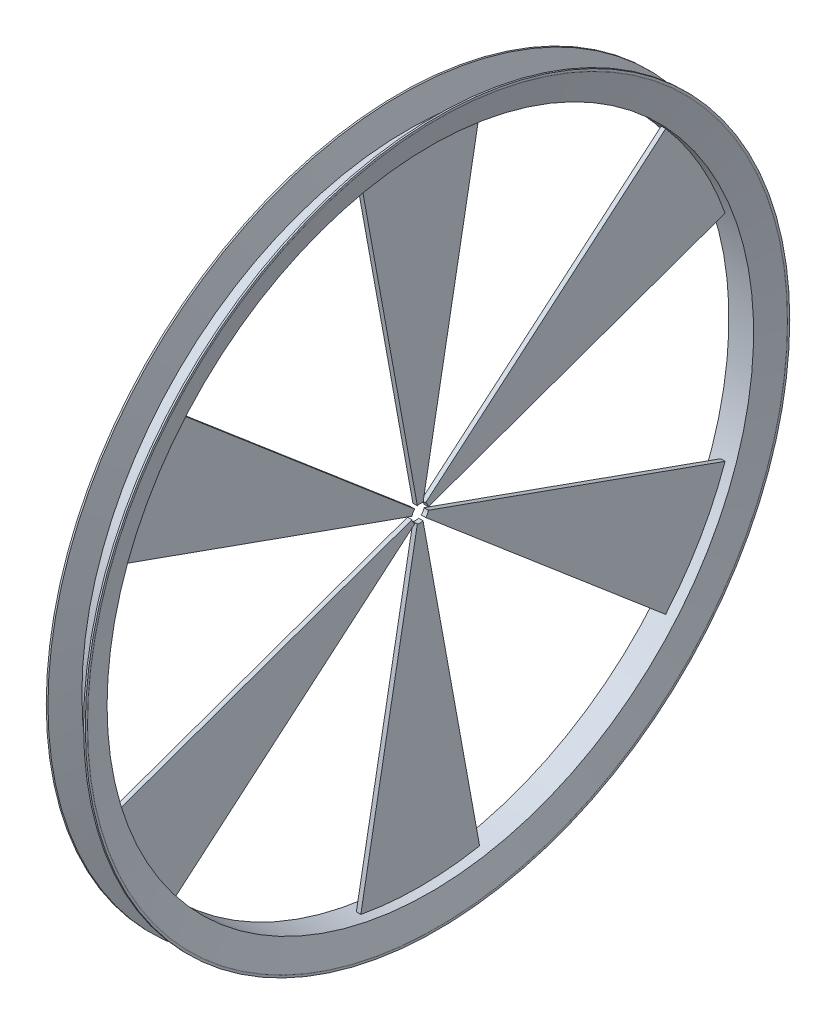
ISO-10303-21;
HEADER;
FILE_DESCRIPTION(('STEP AP214'),'2;1');
FILE_NAME('part.step','',(''),(''),'','','');
FILE_SCHEMA(('AUTOMOTIVE_DESIGN { 1 0 10303 214 1 1 1 1 }'));
ENDSEC;
DATA;
#1=APPLICATION_CONTEXT('core data for automotive mechanical design processes');
#2=APPLICATION_PROTOCOL_DEFINITION('international standard','automotive_design',2000,#1);
#3=PRODUCT_CONTEXT('',#1,'mechanical');
#4=PRODUCT('Part','Part','',(#3));
#5=PRODUCT_RELATED_PRODUCT_CATEGORY('part','',(#4));
#6=PRODUCT_DEFINITION_FORMATION('','',#4);
#7=PRODUCT_DEFINITION_CONTEXT('part definition',#1,'design');
#8=PRODUCT_DEFINITION('design','',#6,#7);
#9=PRODUCT_DEFINITION_SHAPE('','',#8);
#10=(LENGTH_UNIT() NAMED_UNIT(*) SI_UNIT(.MILLI.,.METRE.));
#11=(NAMED_UNIT(*) PLANE_ANGLE_UNIT() SI_UNIT($,.RADIAN.));
#12=(NAMED_UNIT(*) SI_UNIT($,.STERADIAN.) SOLID_ANGLE_UNIT());
#13=UNCERTAINTY_MEASURE_WITH_UNIT(LENGTH_MEASURE(1.E-05),#10,'distance_accuracy_value','');
#14=(GEOMETRIC_REPRESENTATION_CONTEXT(3) GLOBAL_UNCERTAINTY_ASSIGNED_CONTEXT((#13)) GLOBAL_UNIT_ASSIGNED_CONTEXT((#10,
#11,#12)) REPRESENTATION_CONTEXT('',''));
#15=CARTESIAN_POINT('',(0.,0.,0.));
#16=DIRECTION('',(0.,0.,1.));
#17=DIRECTION('',(1.,0.,0.));
#18=AXIS2_PLACEMENT_3D('',#15,#16,#17);
#19=CARTESIAN_POINT('',(-3.65850924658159,-289.525905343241,0.));
#20=DIRECTION('',(-1.,0.,0.));
#21=DIRECTION('',(0.,0.,1.));
#22=AXIS2_PLACEMENT_3D('',#19,#20,#21);
#23=CYLINDRICAL_SURFACE('',#22,290.025905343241);
#24=DIRECTION('',(1.,0.,0.));
#25=VECTOR('',#24,1.);
#26=CARTESIAN_POINT('',(-2.,-385.923205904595,273.53717519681));
#27=LINE('',#26,#25);
#28=CARTESIAN_POINT('',(-2.,-385.923205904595,273.53717519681));
#29=VERTEX_POINT('',#28);
#30=CARTESIAN_POINT('',(2.,-385.923205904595,273.53717519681));
#31=VERTEX_POINT('',#30);
#32=EDGE_CURVE('E64',#29,#31,#27,.T.);
#33=ORIENTED_EDGE('',*,*,#32,.F.);
#34=CARTESIAN_POINT('',(-2.,-289.525905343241,0.));
#35=DIRECTION('',(1.,0.,0.));
#36=DIRECTION('',(0.,0.866025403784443,0.499999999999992));
#37=AXIS2_PLACEMENT_3D('',#34,#35,#36);
#38=CIRCLE('',#37,290.025905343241);
#39=CARTESIAN_POINT('',(-2.,-478.217397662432,220.251098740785));
#40=VERTEX_POINT('',#39);
#41=EDGE_CURVE('E259',#29,#40,#38,.T.);
#42=ORIENTED_EDGE('',*,*,#41,.T.);
#43=DIRECTION('',(1.,0.,0.));
#44=VECTOR('',#43,1.);
#45=CARTESIAN_POINT('',(-2.,-478.217397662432,220.251098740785));
#46=LINE('',#45,#44);
#47=CARTESIAN_POINT('',(2.,-478.217397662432,220.251098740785));
#48=VERTEX_POINT('',#47);
#49=EDGE_CURVE('E253',#40,#48,#46,.T.);
#50=ORIENTED_EDGE('',*,*,#49,.T.);
#51=CARTESIAN_POINT('',(2.,-289.525905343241,0.));
#52=DIRECTION('',(1.,0.,0.));
#53=DIRECTION('',(0.,0.866025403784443,0.499999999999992));
#54=AXIS2_PLACEMENT_3D('',#51,#52,#53);
#55=CIRCLE('',#54,290.025905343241);
#56=EDGE_CURVE('E241',#31,#48,#55,.T.);
#57=ORIENTED_EDGE('',*,*,#56,.F.);
#58=EDGE_LOOP('',(#33,#42,#50,#57));
#59=FACE_BOUND('',#58,.T.);
#60=DIRECTION('',(1.,0.,0.));
#61=VECTOR('',#60,1.);
#62=CARTESIAN_POINT('',(-2.,-478.217397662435,-220.251098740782));
#63=LINE('',#62,#61);
#64=CARTESIAN_POINT('',(-2.,-478.217397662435,-220.251098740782));
#65=VERTEX_POINT('',#64);
#66=CARTESIAN_POINT('',(2.,-478.217397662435,-220.251098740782));
#67=VERTEX_POINT('',#66);
#68=EDGE_CURVE('E333',#65,#67,#63,.T.);
#69=ORIENTED_EDGE('',*,*,#68,.F.);
#70=CARTESIAN_POINT('',(-2.,-289.525905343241,0.));
#71=DIRECTION('',(1.,0.,0.));
#72=DIRECTION('',(0.,-0.866025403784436,0.500000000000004));
#73=AXIS2_PLACEMENT_3D('',#70,#71,#72);
#74=CIRCLE('',#73,290.025905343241);
#75=CARTESIAN_POINT('',(-2.,-385.923205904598,-273.537175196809));
#76=VERTEX_POINT('',#75);
#77=EDGE_CURVE('E322',#65,#76,#74,.T.);
#78=ORIENTED_EDGE('',*,*,#77,.T.);
#79=DIRECTION('',(1.,0.,0.));
#80=VECTOR('',#79,1.);
#81=CARTESIAN_POINT('',(-2.,-385.923205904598,-273.537175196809));
#82=LINE('',#81,#80);
#83=CARTESIAN_POINT('',(2.,-385.923205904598,-273.537175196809));
#84=VERTEX_POINT('',#83);
#85=EDGE_CURVE('E316',#76,#84,#82,.T.);
#86=ORIENTED_EDGE('',*,*,#85,.T.);
#87=CARTESIAN_POINT('',(2.,-289.525905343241,0.));
#88=DIRECTION('',(1.,0.,0.));
#89=DIRECTION('',(0.,-0.866025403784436,0.500000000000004));
#90=AXIS2_PLACEMENT_3D('',#87,#88,#89);
#91=CIRCLE('',#90,290.025905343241);
#92=EDGE_CURVE('E303',#67,#84,#91,.T.);
#93=ORIENTED_EDGE('',*,*,#92,.F.);
#94=EDGE_LOOP('',(#69,#78,#86,#93));
#95=FACE_BOUND('',#94,.T.);
#96=CARTESIAN_POINT('',(-2.,-289.525905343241,0.));
#97=DIRECTION('',(1.,0.,0.));
#98=DIRECTION('',(0.,0.,-1.));
#99=AXIS2_PLACEMENT_3D('',#96,#97,#98);
#100=CIRCLE('',#99,290.025905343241);
#101=CARTESIAN_POINT('',(-2.,-4.43711246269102,-53.286076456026));
#102=VERTEX_POINT('',#101);
#103=CARTESIAN_POINT('',(-2.,-4.43711246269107,53.286076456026));
#104=VERTEX_POINT('',#103);
#105=EDGE_CURVE('E379',#102,#104,#100,.T.);
#106=ORIENTED_EDGE('',*,*,#105,.T.);
#107=DIRECTION('',(1.,0.,0.));
#108=VECTOR('',#107,1.);
#109=CARTESIAN_POINT('',(-2.,-4.43711246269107,53.286076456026));
#110=LINE('',#109,#108);
#111=CARTESIAN_POINT('',(2.,-4.43711246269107,53.286076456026));
#112=VERTEX_POINT('',#111);
#113=EDGE_CURVE('E389',#104,#112,#110,.T.);
#114=ORIENTED_EDGE('',*,*,#113,.T.);
#115=CARTESIAN_POINT('',(2.,-289.525905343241,0.));
#116=DIRECTION('',(1.,0.,0.));
#117=DIRECTION('',(0.,0.,-1.));
#118=AXIS2_PLACEMENT_3D('',#115,#116,#117);
#119=CIRCLE('',#118,290.025905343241);
#120=CARTESIAN_POINT('',(2.,-4.43711246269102,-53.286076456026));
#121=VERTEX_POINT('',#120);
#122=EDGE_CURVE('E367',#121,#112,#119,.T.);
#123=ORIENTED_EDGE('',*,*,#122,.F.);
#124=DIRECTION('',(1.,0.,0.));
#125=VECTOR('',#124,1.);
#126=CARTESIAN_POINT('',(-2.,-4.43711246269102,-53.286076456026));
#127=LINE('',#126,#125);
#128=EDGE_CURVE('E390',#102,#121,#127,.T.);
#129=ORIENTED_EDGE('',*,*,#128,.F.);
#130=EDGE_LOOP('',(#106,#114,#123,#129));
#131=FACE_BOUND('',#130,.T.);
#132=CARTESIAN_POINT('',(11.1025926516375,-289.525905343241,0.));
#133=DIRECTION('',(-1.,0.,0.));
#134=DIRECTION('',(0.,0.,1.));
#135=AXIS2_PLACEMENT_3D('',#132,#133,#134);
#136=CIRCLE('',#135,290.025905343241);
#137=CARTESIAN_POINT('',(11.1025926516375,-289.525905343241,290.025905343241));
#138=VERTEX_POINT('',#137);
#139=EDGE_CURVE('E420',#138,#138,#136,.T.);
#140=ORIENTED_EDGE('',*,*,#139,.F.);
#141=EDGE_LOOP('',(#140));
#142=FACE_BOUND('',#141,.T.);
#143=CARTESIAN_POINT('',(-11.0300413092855,-289.525905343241,0.));
#144=DIRECTION('',(-1.,0.,0.));
#145=DIRECTION('',(0.,0.,1.));
#146=AXIS2_PLACEMENT_3D('',#143,#144,#145);
#147=CIRCLE('',#146,290.025905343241);
#148=CARTESIAN_POINT('',(-11.0300413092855,-289.525905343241,290.025905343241));
#149=VERTEX_POINT('',#148);
#150=EDGE_CURVE('E417',#149,#149,#147,.T.);
#151=ORIENTED_EDGE('',*,*,#150,.T.);
#152=EDGE_LOOP('',(#151));
#153=FACE_BOUND('',#152,.T.);
#154=DIRECTION('',(1.,0.,0.));
#155=VECTOR('',#154,1.);
#156=CARTESIAN_POINT('',(-2.,-193.128604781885,-273.537175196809));
#157=LINE('',#156,#155);
#158=CARTESIAN_POINT('',(-2.,-193.128604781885,-273.537175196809));
#159=VERTEX_POINT('',#158);
#160=CARTESIAN_POINT('',(2.,-193.128604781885,-273.537175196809));
#161=VERTEX_POINT('',#160);
#162=EDGE_CURVE('E365',#159,#161,#157,.T.);
#163=ORIENTED_EDGE('',*,*,#162,.F.);
#164=CARTESIAN_POINT('',(-2.,-289.525905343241,0.));
#165=DIRECTION('',(1.,0.,0.));
#166=DIRECTION('',(0.,-0.86602540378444,-0.499999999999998));
#167=AXIS2_PLACEMENT_3D('',#164,#165,#166);
#168=CIRCLE('',#167,290.025905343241);
#169=CARTESIAN_POINT('',(-2.,-100.834413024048,-220.251098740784));
#170=VERTEX_POINT('',#169);
#171=EDGE_CURVE('E354',#159,#170,#168,.T.);
#172=ORIENTED_EDGE('',*,*,#171,.T.);
#173=DIRECTION('',(1.,0.,0.));
#174=VECTOR('',#173,1.);
#175=CARTESIAN_POINT('',(-2.,-100.834413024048,-220.251098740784));
#176=LINE('',#175,#174);
#177=CARTESIAN_POINT('',(2.,-100.834413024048,-220.251098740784));
#178=VERTEX_POINT('',#177);
#179=EDGE_CURVE('E348',#170,#178,#176,.T.);
#180=ORIENTED_EDGE('',*,*,#179,.T.);
#181=CARTESIAN_POINT('',(2.,-289.525905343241,0.));
#182=DIRECTION('',(1.,0.,0.));
#183=DIRECTION('',(0.,-0.86602540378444,-0.499999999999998));
#184=AXIS2_PLACEMENT_3D('',#181,#182,#183);
#185=CIRCLE('',#184,290.025905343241);
#186=EDGE_CURVE('E335',#161,#178,#185,.T.);
#187=ORIENTED_EDGE('',*,*,#186,.F.);
#188=EDGE_LOOP('',(#163,#172,#180,#187));
#189=FACE_BOUND('',#188,.T.);
#190=DIRECTION('',(1.,0.,0.));
#191=VECTOR('',#190,1.);
#192=CARTESIAN_POINT('',(-2.,-574.61469822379,53.286076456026));
#193=LINE('',#192,#191);
#194=CARTESIAN_POINT('',(-2.,-574.61469822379,53.286076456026));
#195=VERTEX_POINT('',#194);
#196=CARTESIAN_POINT('',(2.,-574.61469822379,53.286076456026));
#197=VERTEX_POINT('',#196);
#198=EDGE_CURVE('E301',#195,#197,#193,.T.);
#199=ORIENTED_EDGE('',*,*,#198,.F.);
#200=CARTESIAN_POINT('',(-2.,-289.525905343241,0.));
#201=DIRECTION('',(1.,0.,0.));
#202=DIRECTION('',(0.,0.,1.));
#203=AXIS2_PLACEMENT_3D('',#200,#201,#202);
#204=CIRCLE('',#203,290.025905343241);
#205=CARTESIAN_POINT('',(-2.,-574.61469822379,-53.286076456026));
#206=VERTEX_POINT('',#205);
#207=EDGE_CURVE('E290',#195,#206,#204,.T.);
#208=ORIENTED_EDGE('',*,*,#207,.T.);
#209=DIRECTION('',(1.,0.,0.));
#210=VECTOR('',#209,1.);
#211=CARTESIAN_POINT('',(-2.,-574.61469822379,-53.286076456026));
#212=LINE('',#211,#210);
#213=CARTESIAN_POINT('',(2.,-574.61469822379,-53.286076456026));
#214=VERTEX_POINT('',#213);
#215=EDGE_CURVE('E284',#206,#214,#212,.T.);
#216=ORIENTED_EDGE('',*,*,#215,.T.);
#217=CARTESIAN_POINT('',(2.,-289.525905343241,0.));
#218=DIRECTION('',(1.,0.,0.));
#219=DIRECTION('',(0.,0.,1.));
#220=AXIS2_PLACEMENT_3D('',#217,#218,#219);
#221=CIRCLE('',#220,290.025905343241);
#222=EDGE_CURVE('E271',#197,#214,#221,.T.);
#223=ORIENTED_EDGE('',*,*,#222,.F.);
#224=EDGE_LOOP('',(#199,#208,#216,#223));
#225=FACE_BOUND('',#224,.T.);
#226=DIRECTION('',(1.,0.,0.));
#227=VECTOR('',#226,1.);
#228=CARTESIAN_POINT('',(-2.,-100.834413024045,220.251098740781));
#229=LINE('',#228,#227);
#230=CARTESIAN_POINT('',(-2.,-100.834413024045,220.251098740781));
#231=VERTEX_POINT('',#230);
#232=CARTESIAN_POINT('',(2.,-100.834413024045,220.251098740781));
#233=VERTEX_POINT('',#232);
#234=EDGE_CURVE('E56',#231,#233,#229,.T.);
#235=ORIENTED_EDGE('',*,*,#234,.F.);
#236=CARTESIAN_POINT('',(-2.,-289.525905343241,0.));
#237=DIRECTION('',(1.,0.,0.));
#238=DIRECTION('',(0.,0.866025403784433,-0.50000000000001));
#239=AXIS2_PLACEMENT_3D('',#236,#237,#238);
#240=CIRCLE('',#239,290.025905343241);
#241=CARTESIAN_POINT('',(-2.,-193.128604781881,273.537175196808));
#242=VERTEX_POINT('',#241);
#243=EDGE_CURVE('E224',#231,#242,#240,.T.);
#244=ORIENTED_EDGE('',*,*,#243,.T.);
#245=DIRECTION('',(1.,0.,0.));
#246=VECTOR('',#245,1.);
#247=CARTESIAN_POINT('',(-2.,-193.128604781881,273.537175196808));
#248=LINE('',#247,#246);
#249=CARTESIAN_POINT('',(2.,-193.128604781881,273.537175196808));
#250=VERTEX_POINT('',#249);
#251=EDGE_CURVE('E218',#242,#250,#248,.T.);
#252=ORIENTED_EDGE('',*,*,#251,.T.);
#253=CARTESIAN_POINT('',(2.,-289.525905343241,0.));
#254=DIRECTION('',(1.,0.,0.));
#255=DIRECTION('',(0.,0.866025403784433,-0.50000000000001));
#256=AXIS2_PLACEMENT_3D('',#253,#254,#255);
#257=CIRCLE('',#256,290.025905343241);
#258=EDGE_CURVE('E205',#233,#250,#257,.T.);
#259=ORIENTED_EDGE('',*,*,#258,.F.);
#260=EDGE_LOOP('',(#235,#244,#252,#259));
#261=FACE_BOUND('',#260,.T.);
#262=ADVANCED_FACE('F41',(#59,#95,#131,#142,#153,#189,#225,#261),#23,.F.);
#263=CARTESIAN_POINT('',(-3.65850924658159,-289.525905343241,0.));
#264=DIRECTION('',(-1.,0.,0.));
#265=DIRECTION('',(0.,0.,1.));
#266=AXIS2_PLACEMENT_3D('',#263,#264,#265);
#267=CYLINDRICAL_SURFACE('',#266,316.025905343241);
#268=CARTESIAN_POINT('',(15.9987192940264,-289.525905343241,0.));
#269=DIRECTION('',(-1.,0.,0.));
#270=DIRECTION('',(0.,0.,1.));
#271=AXIS2_PLACEMENT_3D('',#268,#269,#270);
#272=CIRCLE('',#271,316.025905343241);
#273=CARTESIAN_POINT('',(15.9987192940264,-289.525905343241,316.025905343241));
#274=VERTEX_POINT('',#273);
#275=EDGE_CURVE('E393',#274,#274,#272,.T.);
#276=ORIENTED_EDGE('',*,*,#275,.F.);
#277=EDGE_LOOP('',(#276));
#278=FACE_BOUND('',#277,.T.);
#279=CARTESIAN_POINT('',(17.536275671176,-289.525905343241,0.));
#280=DIRECTION('',(-1.,0.,0.));
#281=DIRECTION('',(0.,0.,1.));
#282=AXIS2_PLACEMENT_3D('',#279,#280,#281);
#283=CIRCLE('',#282,316.025905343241);
#284=CARTESIAN_POINT('',(17.536275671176,-289.525905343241,316.025905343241));
#285=VERTEX_POINT('',#284);
#286=EDGE_CURVE('E11',#285,#285,#283,.T.);
#287=ORIENTED_EDGE('',*,*,#286,.T.);
#288=EDGE_LOOP('',(#287));
#289=FACE_BOUND('',#288,.T.);
#290=ADVANCED_FACE('F43',(#278,#289),#267,.T.);
#291=CARTESIAN_POINT('',(17.536275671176,24.6424844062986,0.));
#292=DIRECTION('',(-1.,0.,0.));
#293=DIRECTION('',(0.,0.,1.));
#294=AXIS2_PLACEMENT_3D('',#291,#292,#293);
#295=PLANE('',#294);
#296=ORIENTED_EDGE('',*,*,#286,.F.);
#297=EDGE_LOOP('',(#296));
#298=FACE_BOUND('',#297,.T.);
#299=CARTESIAN_POINT('',(17.536275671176,-289.525905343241,0.));
#300=DIRECTION('',(-1.,0.,0.));
#301=DIRECTION('',(0.,0.,1.));
#302=AXIS2_PLACEMENT_3D('',#299,#300,#301);
#303=CIRCLE('',#302,314.168389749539);
#304=CARTESIAN_POINT('',(17.536275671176,-289.525905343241,314.168389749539));
#305=VERTEX_POINT('',#304);
#306=EDGE_CURVE('E49',#305,#305,#303,.T.);
#307=ORIENTED_EDGE('',*,*,#306,.T.);
#308=EDGE_LOOP('',(#307));
#309=FACE_BOUND('',#308,.T.);
#310=ADVANCED_FACE('F428',(#298,#309),#295,.F.);
#311=CARTESIAN_POINT('',(16.536275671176,-289.525905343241,0.));
#312=DIRECTION('',(-1.,0.,0.));
#313=DIRECTION('',(0.,0.,1.));
#314=AXIS2_PLACEMENT_3D('',#311,#312,#313);
#315=TOROIDAL_SURFACE('',#314,314.168389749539,1.);
#316=ORIENTED_EDGE('',*,*,#306,.F.);
#317=EDGE_LOOP('',(#316));
#318=FACE_BOUND('',#317,.T.);
#319=CARTESIAN_POINT('',(17.5022014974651,-289.525905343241,0.));
#320=DIRECTION('',(-1.,0.,0.));
#321=DIRECTION('',(0.,0.,1.));
#322=AXIS2_PLACEMENT_3D('',#319,#320,#321);
#323=CIRCLE('',#322,313.909570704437);
#324=CARTESIAN_POINT('',(17.5022014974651,-289.525905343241,313.909570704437));
#325=VERTEX_POINT('',#324);
#326=EDGE_CURVE('E423',#325,#325,#323,.T.);
#327=ORIENTED_EDGE('',*,*,#326,.T.);
#328=EDGE_LOOP('',(#327));
#329=FACE_BOUND('',#328,.T.);
#330=ADVANCED_FACE('F430',(#318,#329),#315,.T.);
#331=CARTESIAN_POINT('',(11.1025926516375,-289.525905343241,0.));
#332=DIRECTION('',(1.,0.,0.));
#333=DIRECTION('',(0.,0.,-1.));
#334=AXIS2_PLACEMENT_3D('',#331,#332,#333);
#335=CONICAL_SURFACE('',#334,290.025905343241,1.30899693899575);
#336=ORIENTED_EDGE('',*,*,#326,.F.);
#337=EDGE_LOOP('',(#336));
#338=FACE_BOUND('',#337,.T.);
#339=ORIENTED_EDGE('',*,*,#139,.T.);
#340=EDGE_LOOP('',(#339));
#341=FACE_BOUND('',#340,.T.);
#342=ADVANCED_FACE('F433',(#338,#341),#335,.F.);
#343=CARTESIAN_POINT('',(-17.463724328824,-289.525905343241,0.));
#344=DIRECTION('',(-1.,0.,0.));
#345=DIRECTION('',(0.,0.,1.));
#346=AXIS2_PLACEMENT_3D('',#343,#344,#345);
#347=CONICAL_SURFACE('',#346,314.036737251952,1.30899693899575);
#348=ORIENTED_EDGE('',*,*,#150,.F.);
#349=EDGE_LOOP('',(#348));
#350=FACE_BOUND('',#349,.T.);
#351=CARTESIAN_POINT('',(-17.463724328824,-289.525905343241,0.));
#352=DIRECTION('',(-1.,0.,0.));
#353=DIRECTION('',(0.,0.,1.));
#354=AXIS2_PLACEMENT_3D('',#351,#352,#353);
#355=CIRCLE('',#354,314.036737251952);
#356=CARTESIAN_POINT('',(-17.463724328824,-289.525905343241,314.036737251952));
#357=VERTEX_POINT('',#356);
#358=EDGE_CURVE('E414',#357,#357,#355,.T.);
#359=ORIENTED_EDGE('',*,*,#358,.T.);
#360=EDGE_LOOP('',(#359));
#361=FACE_BOUND('',#360,.T.);
#362=ADVANCED_FACE('F439',(#350,#361),#347,.F.);
#363=CARTESIAN_POINT('',(-17.463724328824,24.6424844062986,0.));
#364=DIRECTION('',(1.,0.,0.));
#365=DIRECTION('',(0.,0.,-1.));
#366=AXIS2_PLACEMENT_3D('',#363,#364,#365);
#367=PLANE('',#366);
#368=ORIENTED_EDGE('',*,*,#358,.F.);
#369=EDGE_LOOP('',(#368));
#370=FACE_BOUND('',#369,.T.);
#371=CARTESIAN_POINT('',(-17.463724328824,-289.525905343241,0.));
#372=DIRECTION('',(-1.,0.,0.));
#373=DIRECTION('',(0.,0.,1.));
#374=AXIS2_PLACEMENT_3D('',#371,#372,#373);
#375=CIRCLE('',#374,316.025905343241);
#376=CARTESIAN_POINT('',(-17.463724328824,-289.525905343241,316.025905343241));
#377=VERTEX_POINT('',#376);
#378=EDGE_CURVE('E411',#377,#377,#375,.T.);
#379=ORIENTED_EDGE('',*,*,#378,.T.);
#380=EDGE_LOOP('',(#379));
#381=FACE_BOUND('',#380,.T.);
#382=ADVANCED_FACE('F557',(#370,#381),#367,.F.);
#383=CARTESIAN_POINT('',(-3.65850924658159,-289.525905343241,0.));
#384=DIRECTION('',(-1.,0.,0.));
#385=DIRECTION('',(0.,0.,1.));
#386=AXIS2_PLACEMENT_3D('',#383,#384,#385);
#387=CYLINDRICAL_SURFACE('',#386,316.025905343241);
#388=ORIENTED_EDGE('',*,*,#378,.F.);
#389=EDGE_LOOP('',(#388));
#390=FACE_BOUND('',#389,.T.);
#391=CARTESIAN_POINT('',(-15.9261679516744,-289.525905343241,0.));
#392=DIRECTION('',(-1.,0.,0.));
#393=DIRECTION('',(0.,0.,1.));
#394=AXIS2_PLACEMENT_3D('',#391,#392,#393);
#395=CIRCLE('',#394,316.025905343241);
#396=CARTESIAN_POINT('',(-15.9261679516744,-289.525905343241,316.025905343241));
#397=VERTEX_POINT('',#396);
#398=EDGE_CURVE('E408',#397,#397,#395,.T.);
#399=ORIENTED_EDGE('',*,*,#398,.T.);
#400=EDGE_LOOP('',(#399));
#401=FACE_BOUND('',#400,.T.);
#402=ADVANCED_FACE('F553',(#390,#401),#387,.T.);
#403=CARTESIAN_POINT('',(-9.49538733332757,-289.525905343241,0.));
#404=DIRECTION('',(-1.,0.,0.));
#405=DIRECTION('',(0.,0.,1.));
#406=AXIS2_PLACEMENT_3D('',#403,#404,#405);
#407=CONICAL_SURFACE('',#406,292.025905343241,1.30899693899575);
#408=ORIENTED_EDGE('',*,*,#398,.F.);
#409=EDGE_LOOP('',(#408));
#410=FACE_BOUND('',#409,.T.);
#411=CARTESIAN_POINT('',(-9.49538733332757,-289.525905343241,0.));
#412=DIRECTION('',(-1.,0.,0.));
#413=DIRECTION('',(0.,0.,1.));
#414=AXIS2_PLACEMENT_3D('',#411,#412,#413);
#415=CIRCLE('',#414,292.025905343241);
#416=CARTESIAN_POINT('',(-9.49538733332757,-289.525905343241,292.025905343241));
#417=VERTEX_POINT('',#416);
#418=EDGE_CURVE('E405',#417,#417,#415,.T.);
#419=ORIENTED_EDGE('',*,*,#418,.T.);
#420=EDGE_LOOP('',(#419));
#421=FACE_BOUND('',#420,.T.);
#422=ADVANCED_FACE('F549',(#410,#421),#407,.T.);
#423=CARTESIAN_POINT('',(-3.65850924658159,-289.525905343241,0.));
#424=DIRECTION('',(-1.,0.,0.));
#425=DIRECTION('',(0.,0.,1.));
#426=AXIS2_PLACEMENT_3D('',#423,#424,#425);
#427=CYLINDRICAL_SURFACE('',#426,292.025905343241);
#428=ORIENTED_EDGE('',*,*,#418,.F.);
#429=EDGE_LOOP('',(#428));
#430=FACE_BOUND('',#429,.T.);
#431=CARTESIAN_POINT('',(9.56793867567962,-289.525905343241,0.));
#432=DIRECTION('',(-1.,0.,0.));
#433=DIRECTION('',(0.,0.,1.));
#434=AXIS2_PLACEMENT_3D('',#431,#432,#433);
#435=CIRCLE('',#434,292.025905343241);
#436=CARTESIAN_POINT('',(9.56793867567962,-289.525905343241,292.025905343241));
#437=VERTEX_POINT('',#436);
#438=EDGE_CURVE('E402',#437,#437,#435,.T.);
#439=ORIENTED_EDGE('',*,*,#438,.T.);
#440=EDGE_LOOP('',(#439));
#441=FACE_BOUND('',#440,.T.);
#442=ADVANCED_FACE('F545',(#430,#441),#427,.T.);
#443=CARTESIAN_POINT('',(15.9987192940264,-289.525905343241,0.));
#444=DIRECTION('',(1.,0.,0.));
#445=DIRECTION('',(0.,0.,-1.));
#446=AXIS2_PLACEMENT_3D('',#443,#444,#445);
#447=CONICAL_SURFACE('',#446,316.025905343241,1.30899693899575);
#448=ORIENTED_EDGE('',*,*,#438,.F.);
#449=EDGE_LOOP('',(#448));
#450=FACE_BOUND('',#449,.T.);
#451=ORIENTED_EDGE('',*,*,#275,.T.);
#452=EDGE_LOOP('',(#451));
#453=FACE_BOUND('',#452,.T.);
#454=ADVANCED_FACE('F535',(#450,#453),#447,.T.);
#455=CARTESIAN_POINT('',(-2.,-4.43711246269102,-53.286076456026));
#456=DIRECTION('',(0.,0.179558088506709,0.983747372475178));
#457=DIRECTION('',(0.,-0.983747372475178,0.179558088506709));
#458=AXIS2_PLACEMENT_3D('',#455,#456,#457);
#459=PLANE('',#458);
#460=ORIENTED_EDGE('',*,*,#128,.T.);
#461=DIRECTION('',(0.,-0.983747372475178,0.179558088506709));
#462=VECTOR('',#461,1.);
#463=CARTESIAN_POINT('',(2.,-4.43711246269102,-53.286076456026));
#464=LINE('',#463,#462);
#465=CARTESIAN_POINT('',(2.,-282.468566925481,-2.53849846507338));
#466=VERTEX_POINT('',#465);
#467=EDGE_CURVE('E376',#121,#466,#464,.T.);
#468=ORIENTED_EDGE('',*,*,#467,.T.);
#469=DIRECTION('',(1.,0.,0.));
#470=VECTOR('',#469,1.);
#471=CARTESIAN_POINT('',(-2.,-282.468566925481,-2.53849846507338));
#472=LINE('',#471,#470);
#473=CARTESIAN_POINT('',(-2.,-282.468566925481,-2.53849846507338));
#474=VERTEX_POINT('',#473);
#475=EDGE_CURVE('E394',#474,#466,#472,.T.);
#476=ORIENTED_EDGE('',*,*,#475,.F.);
#477=DIRECTION('',(0.,-0.983747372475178,0.179558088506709));
#478=VECTOR('',#477,1.);
#479=CARTESIAN_POINT('',(-2.,-4.43711246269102,-53.286076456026));
#480=LINE('',#479,#478);
#481=EDGE_CURVE('E387',#102,#474,#480,.T.);
#482=ORIENTED_EDGE('',*,*,#481,.F.);
#483=EDGE_LOOP('',(#460,#468,#476,#482));
#484=FACE_BOUND('',#483,.T.);
#485=ADVANCED_FACE('F531',(#484),#459,.F.);
#486=CARTESIAN_POINT('',(-2.,-289.525905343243,-1.52655665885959E-13));
#487=DIRECTION('',(1.,0.,0.));
#488=DIRECTION('',(0.,0.,-1.));
#489=AXIS2_PLACEMENT_3D('',#486,#487,#488);
#490=CYLINDRICAL_SURFACE('',#489,7.49999999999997);
#491=ORIENTED_EDGE('',*,*,#475,.T.);
#492=CARTESIAN_POINT('',(2.,-289.525905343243,-1.52655665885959E-13));
#493=DIRECTION('',(1.,0.,0.));
#494=DIRECTION('',(0.,0.,-1.));
#495=AXIS2_PLACEMENT_3D('',#492,#493,#494);
#496=CIRCLE('',#495,7.49999999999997);
#497=CARTESIAN_POINT('',(2.,-282.468566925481,2.53849846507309));
#498=VERTEX_POINT('',#497);
#499=EDGE_CURVE('E373',#466,#498,#496,.T.);
#500=ORIENTED_EDGE('',*,*,#499,.T.);
#501=DIRECTION('',(1.,0.,0.));
#502=VECTOR('',#501,1.);
#503=CARTESIAN_POINT('',(-2.,-282.468566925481,2.53849846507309));
#504=LINE('',#503,#502);
#505=CARTESIAN_POINT('',(-2.,-282.468566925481,2.53849846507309));
#506=VERTEX_POINT('',#505);
#507=EDGE_CURVE('E396',#506,#498,#504,.T.);
#508=ORIENTED_EDGE('',*,*,#507,.F.);
#509=CARTESIAN_POINT('',(-2.,-289.525905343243,-1.52655665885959E-13));
#510=DIRECTION('',(1.,0.,0.));
#511=DIRECTION('',(0.,0.,-1.));
#512=AXIS2_PLACEMENT_3D('',#509,#510,#511);
#513=CIRCLE('',#512,7.49999999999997);
#514=EDGE_CURVE('E385',#474,#506,#513,.T.);
#515=ORIENTED_EDGE('',*,*,#514,.F.);
#516=EDGE_LOOP('',(#491,#500,#508,#515));
#517=FACE_BOUND('',#516,.T.);
#518=ADVANCED_FACE('F534',(#517),#490,.F.);
#519=CARTESIAN_POINT('',(-2.,-4.43711246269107,53.286076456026));
#520=DIRECTION('',(0.,-0.179558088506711,0.983747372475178));
#521=DIRECTION('',(0.,-0.983747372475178,-0.179558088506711));
#522=AXIS2_PLACEMENT_3D('',#519,#520,#521);
#523=PLANE('',#522);
#524=ORIENTED_EDGE('',*,*,#507,.T.);
#525=DIRECTION('',(0.,-0.983747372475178,-0.17955808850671));
#526=VECTOR('',#525,1.);
#527=CARTESIAN_POINT('',(2.,-4.43711246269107,53.286076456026));
#528=LINE('',#527,#526);
#529=EDGE_CURVE('E370',#112,#498,#528,.T.);
#530=ORIENTED_EDGE('',*,*,#529,.F.);
#531=ORIENTED_EDGE('',*,*,#113,.F.);
#532=DIRECTION('',(0.,-0.983747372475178,-0.17955808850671));
#533=VECTOR('',#532,1.);
#534=CARTESIAN_POINT('',(-2.,-4.43711246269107,53.286076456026));
#535=LINE('',#534,#533);
#536=EDGE_CURVE('E382',#104,#506,#535,.T.);
#537=ORIENTED_EDGE('',*,*,#536,.T.);
#538=EDGE_LOOP('',(#524,#530,#531,#537));
#539=FACE_BOUND('',#538,.T.);
#540=ADVANCED_FACE('F529',(#539),#523,.T.);
#541=CARTESIAN_POINT('',(-2.,-289.525905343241,0.));
#542=DIRECTION('',(1.,0.,0.));
#543=DIRECTION('',(0.,0.,-1.));
#544=AXIS2_PLACEMENT_3D('',#541,#542,#543);
#545=PLANE('',#544);
#546=ORIENTED_EDGE('',*,*,#105,.F.);
#547=ORIENTED_EDGE('',*,*,#481,.T.);
#548=ORIENTED_EDGE('',*,*,#514,.T.);
#549=ORIENTED_EDGE('',*,*,#536,.F.);
#550=EDGE_LOOP('',(#546,#547,#548,#549));
#551=FACE_BOUND('',#550,.T.);
#552=ADVANCED_FACE('F525',(#551),#545,.F.);
#553=CARTESIAN_POINT('',(2.,-289.525905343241,0.));
#554=DIRECTION('',(1.,0.,0.));
#555=DIRECTION('',(0.,0.,-1.));
#556=AXIS2_PLACEMENT_3D('',#553,#554,#555);
#557=PLANE('',#556);
#558=ORIENTED_EDGE('',*,*,#122,.T.);
#559=ORIENTED_EDGE('',*,*,#529,.T.);
#560=ORIENTED_EDGE('',*,*,#499,.F.);
#561=ORIENTED_EDGE('',*,*,#467,.F.);
#562=EDGE_LOOP('',(#558,#559,#560,#561));
#563=FACE_BOUND('',#562,.T.);
#564=ADVANCED_FACE('F521',(#563),#557,.T.);
#565=CARTESIAN_POINT('',(-2.,-193.128604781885,-273.537175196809));
#566=DIRECTION('',(0.,0.941729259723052,0.336371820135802));
#567=DIRECTION('',(0.,-0.336371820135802,0.941729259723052));
#568=AXIS2_PLACEMENT_3D('',#565,#566,#567);
#569=PLANE('',#568);
#570=ORIENTED_EDGE('',*,*,#162,.T.);
#571=DIRECTION('',(0.,-0.336371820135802,0.941729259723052));
#572=VECTOR('',#571,1.);
#573=CARTESIAN_POINT('',(2.,-193.128604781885,-273.537175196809));
#574=LINE('',#573,#572);
#575=CARTESIAN_POINT('',(2.,-288.195640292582,-7.3810835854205));
#576=VERTEX_POINT('',#575);
#577=EDGE_CURVE('E342',#161,#576,#574,.T.);
#578=ORIENTED_EDGE('',*,*,#577,.T.);
#579=DIRECTION('',(1.,0.,0.));
#580=VECTOR('',#579,1.);
#581=CARTESIAN_POINT('',(-2.,-288.195640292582,-7.3810835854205));
#582=LINE('',#581,#580);
#583=CARTESIAN_POINT('',(-2.,-288.195640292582,-7.3810835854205));
#584=VERTEX_POINT('',#583);
#585=EDGE_CURVE('E362',#584,#576,#582,.T.);
#586=ORIENTED_EDGE('',*,*,#585,.F.);
#587=DIRECTION('',(0.,-0.336371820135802,0.941729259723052));
#588=VECTOR('',#587,1.);
#589=CARTESIAN_POINT('',(-2.,-193.128604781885,-273.537175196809));
#590=LINE('',#589,#588);
#591=EDGE_CURVE('E357',#159,#584,#590,.T.);
#592=ORIENTED_EDGE('',*,*,#591,.F.);
#593=EDGE_LOOP('',(#570,#578,#586,#592));
#594=FACE_BOUND('',#593,.T.);
#595=ADVANCED_FACE('F517',(#594),#569,.F.);
#596=CARTESIAN_POINT('',(-2.,-289.525905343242,1.99840144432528E-12));
#597=DIRECTION('',(1.,0.,0.));
#598=DIRECTION('',(0.,-0.86602540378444,-0.499999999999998));
#599=AXIS2_PLACEMENT_3D('',#596,#597,#598);
#600=CYLINDRICAL_SURFACE('',#599,7.49999999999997);
#601=ORIENTED_EDGE('',*,*,#585,.T.);
#602=CARTESIAN_POINT('',(2.,-289.525905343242,1.99840144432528E-12));
#603=DIRECTION('',(1.,0.,0.));
#604=DIRECTION('',(0.,-0.86602540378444,-0.499999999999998));
#605=AXIS2_PLACEMENT_3D('',#602,#603,#604);
#606=CIRCLE('',#605,7.49999999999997);
#607=CARTESIAN_POINT('',(2.,-283.79883197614,-4.84258512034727));
#608=VERTEX_POINT('',#607);
#609=EDGE_CURVE('E339',#576,#608,#606,.T.);
#610=ORIENTED_EDGE('',*,*,#609,.T.);
#611=DIRECTION('',(1.,0.,0.));
#612=VECTOR('',#611,1.);
#613=CARTESIAN_POINT('',(-2.,-283.79883197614,-4.84258512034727));
#614=LINE('',#613,#612);
#615=CARTESIAN_POINT('',(-2.,-283.79883197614,-4.84258512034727));
#616=VERTEX_POINT('',#615);
#617=EDGE_CURVE('E345',#616,#608,#614,.T.);
#618=ORIENTED_EDGE('',*,*,#617,.F.);
#619=CARTESIAN_POINT('',(-2.,-289.525905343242,1.99840144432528E-12));
#620=DIRECTION('',(1.,0.,0.));
#621=DIRECTION('',(0.,-0.86602540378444,-0.499999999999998));
#622=AXIS2_PLACEMENT_3D('',#619,#620,#621);
#623=CIRCLE('',#622,7.49999999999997);
#624=EDGE_CURVE('E359',#584,#616,#623,.T.);
#625=ORIENTED_EDGE('',*,*,#624,.F.);
#626=EDGE_LOOP('',(#601,#610,#618,#625));
#627=FACE_BOUND('',#626,.T.);
#628=ADVANCED_FACE('F513',(#627),#600,.F.);
#629=CARTESIAN_POINT('',(-2.,-289.525905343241,0.));
#630=DIRECTION('',(1.,0.,0.));
#631=DIRECTION('',(0.,-0.86602540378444,-0.499999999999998));
#632=AXIS2_PLACEMENT_3D('',#629,#630,#631);
#633=PLANE('',#632);
#634=ORIENTED_EDGE('',*,*,#171,.F.);
#635=ORIENTED_EDGE('',*,*,#591,.T.);
#636=ORIENTED_EDGE('',*,*,#624,.T.);
#637=DIRECTION('',(0.,-0.647375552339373,0.762171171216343));
#638=VECTOR('',#637,1.);
#639=CARTESIAN_POINT('',(-2.,-100.834413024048,-220.251098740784));
#640=LINE('',#639,#638);
#641=EDGE_CURVE('E351',#170,#616,#640,.T.);
#642=ORIENTED_EDGE('',*,*,#641,.F.);
#643=EDGE_LOOP('',(#634,#635,#636,#642));
#644=FACE_BOUND('',#643,.T.);
#645=ADVANCED_FACE('F509',(#644),#633,.F.);
#646=CARTESIAN_POINT('',(-2.,-100.834413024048,-220.251098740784));
#647=DIRECTION('',(0.,0.762171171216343,0.647375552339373));
#648=DIRECTION('',(0.,-0.647375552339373,0.762171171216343));
#649=AXIS2_PLACEMENT_3D('',#646,#647,#648);
#650=PLANE('',#649);
#651=ORIENTED_EDGE('',*,*,#617,.T.);
#652=DIRECTION('',(0.,-0.647375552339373,0.762171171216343));
#653=VECTOR('',#652,1.);
#654=CARTESIAN_POINT('',(2.,-100.834413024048,-220.251098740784));
#655=LINE('',#654,#653);
#656=EDGE_CURVE('E337',#178,#608,#655,.T.);
#657=ORIENTED_EDGE('',*,*,#656,.F.);
#658=ORIENTED_EDGE('',*,*,#179,.F.);
#659=ORIENTED_EDGE('',*,*,#641,.T.);
#660=EDGE_LOOP('',(#651,#657,#658,#659));
#661=FACE_BOUND('',#660,.T.);
#662=ADVANCED_FACE('F505',(#661),#650,.T.);
#663=CARTESIAN_POINT('',(2.,-289.525905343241,0.));
#664=DIRECTION('',(1.,0.,0.));
#665=DIRECTION('',(0.,-0.86602540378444,-0.499999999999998));
#666=AXIS2_PLACEMENT_3D('',#663,#664,#665);
#667=PLANE('',#666);
#668=ORIENTED_EDGE('',*,*,#186,.T.);
#669=ORIENTED_EDGE('',*,*,#656,.T.);
#670=ORIENTED_EDGE('',*,*,#609,.F.);
#671=ORIENTED_EDGE('',*,*,#577,.F.);
#672=EDGE_LOOP('',(#668,#669,#670,#671));
#673=FACE_BOUND('',#672,.T.);
#674=ADVANCED_FACE('F501',(#673),#667,.T.);
#675=CARTESIAN_POINT('',(-2.,-478.217397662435,-220.251098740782));
#676=DIRECTION('',(0.,0.762171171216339,-0.647375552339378));
#677=DIRECTION('',(0.,0.647375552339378,0.762171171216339));
#678=AXIS2_PLACEMENT_3D('',#675,#676,#677);
#679=PLANE('',#678);
#680=ORIENTED_EDGE('',*,*,#68,.T.);
#681=DIRECTION('',(0.,0.647375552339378,0.762171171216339));
#682=VECTOR('',#681,1.);
#683=CARTESIAN_POINT('',(2.,-478.217397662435,-220.251098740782));
#684=LINE('',#683,#682);
#685=CARTESIAN_POINT('',(2.,-295.252978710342,-4.84258512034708));
#686=VERTEX_POINT('',#685);
#687=EDGE_CURVE('E310',#67,#686,#684,.T.);
#688=ORIENTED_EDGE('',*,*,#687,.T.);
#689=DIRECTION('',(1.,0.,0.));
#690=VECTOR('',#689,1.);
#691=CARTESIAN_POINT('',(-2.,-295.252978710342,-4.84258512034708));
#692=LINE('',#691,#690);
#693=CARTESIAN_POINT('',(-2.,-295.252978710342,-4.84258512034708));
#694=VERTEX_POINT('',#693);
#695=EDGE_CURVE('E330',#694,#686,#692,.T.);
#696=ORIENTED_EDGE('',*,*,#695,.F.);
#697=DIRECTION('',(0.,0.647375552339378,0.762171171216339));
#698=VECTOR('',#697,1.);
#699=CARTESIAN_POINT('',(-2.,-478.217397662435,-220.251098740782));
#700=LINE('',#699,#698);
#701=EDGE_CURVE('E325',#65,#694,#700,.T.);
#702=ORIENTED_EDGE('',*,*,#701,.F.);
#703=EDGE_LOOP('',(#680,#688,#696,#702));
#704=FACE_BOUND('',#703,.T.);
#705=ADVANCED_FACE('F497',(#704),#679,.F.);
#706=CARTESIAN_POINT('',(-2.,-289.52590534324,2.05391259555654E-12));
#707=DIRECTION('',(1.,0.,0.));
#708=DIRECTION('',(0.,-0.866025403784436,0.500000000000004));
#709=AXIS2_PLACEMENT_3D('',#706,#707,#708);
#710=CYLINDRICAL_SURFACE('',#709,7.49999999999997);
#711=ORIENTED_EDGE('',*,*,#695,.T.);
#712=CARTESIAN_POINT('',(2.,-289.52590534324,2.05391259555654E-12));
#713=DIRECTION('',(1.,0.,0.));
#714=DIRECTION('',(0.,-0.866025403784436,0.500000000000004));
#715=AXIS2_PLACEMENT_3D('',#712,#713,#714);
#716=CIRCLE('',#715,7.49999999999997);
#717=CARTESIAN_POINT('',(2.,-290.8561703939,-7.38108358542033));
#718=VERTEX_POINT('',#717);
#719=EDGE_CURVE('E307',#686,#718,#716,.T.);
#720=ORIENTED_EDGE('',*,*,#719,.T.);
#721=DIRECTION('',(1.,0.,0.));
#722=VECTOR('',#721,1.);
#723=CARTESIAN_POINT('',(-2.,-290.8561703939,-7.38108358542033));
#724=LINE('',#723,#722);
#725=CARTESIAN_POINT('',(-2.,-290.8561703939,-7.38108358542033));
#726=VERTEX_POINT('',#725);
#727=EDGE_CURVE('E313',#726,#718,#724,.T.);
#728=ORIENTED_EDGE('',*,*,#727,.F.);
#729=CARTESIAN_POINT('',(-2.,-289.52590534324,2.05391259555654E-12));
#730=DIRECTION('',(1.,0.,0.));
#731=DIRECTION('',(0.,-0.866025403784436,0.500000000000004));
#732=AXIS2_PLACEMENT_3D('',#729,#730,#731);
#733=CIRCLE('',#732,7.49999999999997);
#734=EDGE_CURVE('E327',#694,#726,#733,.T.);
#735=ORIENTED_EDGE('',*,*,#734,.F.);
#736=EDGE_LOOP('',(#711,#720,#728,#735));
#737=FACE_BOUND('',#736,.T.);
#738=ADVANCED_FACE('F493',(#737),#710,.F.);
#739=CARTESIAN_POINT('',(-2.,-289.525905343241,0.));
#740=DIRECTION('',(1.,0.,0.));
#741=DIRECTION('',(0.,-0.866025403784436,0.500000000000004));
#742=AXIS2_PLACEMENT_3D('',#739,#740,#741);
#743=PLANE('',#742);
#744=ORIENTED_EDGE('',*,*,#77,.F.);
#745=ORIENTED_EDGE('',*,*,#701,.T.);
#746=ORIENTED_EDGE('',*,*,#734,.T.);
#747=DIRECTION('',(0.,0.336371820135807,0.94172925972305));
#748=VECTOR('',#747,1.);
#749=CARTESIAN_POINT('',(-2.,-385.923205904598,-273.537175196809));
#750=LINE('',#749,#748);
#751=EDGE_CURVE('E319',#76,#726,#750,.T.);
#752=ORIENTED_EDGE('',*,*,#751,.F.);
#753=EDGE_LOOP('',(#744,#745,#746,#752));
#754=FACE_BOUND('',#753,.T.);
#755=ADVANCED_FACE('F489',(#754),#743,.F.);
#756=CARTESIAN_POINT('',(-2.,-385.923205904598,-273.537175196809));
#757=DIRECTION('',(0.,0.94172925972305,-0.336371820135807));
#758=DIRECTION('',(0.,0.336371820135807,0.94172925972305));
#759=AXIS2_PLACEMENT_3D('',#756,#757,#758);
#760=PLANE('',#759);
#761=ORIENTED_EDGE('',*,*,#727,.T.);
#762=DIRECTION('',(0.,0.336371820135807,0.94172925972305));
#763=VECTOR('',#762,1.);
#764=CARTESIAN_POINT('',(2.,-385.923205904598,-273.537175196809));
#765=LINE('',#764,#763);
#766=EDGE_CURVE('E305',#84,#718,#765,.T.);
#767=ORIENTED_EDGE('',*,*,#766,.F.);
#768=ORIENTED_EDGE('',*,*,#85,.F.);
#769=ORIENTED_EDGE('',*,*,#751,.T.);
#770=EDGE_LOOP('',(#761,#767,#768,#769));
#771=FACE_BOUND('',#770,.T.);
#772=ADVANCED_FACE('F485',(#771),#760,.T.);
#773=CARTESIAN_POINT('',(2.,-289.525905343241,0.));
#774=DIRECTION('',(1.,0.,0.));
#775=DIRECTION('',(0.,-0.866025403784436,0.500000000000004));
#776=AXIS2_PLACEMENT_3D('',#773,#774,#775);
#777=PLANE('',#776);
#778=ORIENTED_EDGE('',*,*,#92,.T.);
#779=ORIENTED_EDGE('',*,*,#766,.T.);
#780=ORIENTED_EDGE('',*,*,#719,.F.);
#781=ORIENTED_EDGE('',*,*,#687,.F.);
#782=EDGE_LOOP('',(#778,#779,#780,#781));
#783=FACE_BOUND('',#782,.T.);
#784=ADVANCED_FACE('F482',(#783),#777,.T.);
#785=CARTESIAN_POINT('',(-2.,-574.61469822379,53.286076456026));
#786=DIRECTION('',(0.,-0.179558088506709,-0.983747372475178));
#787=DIRECTION('',(0.,0.983747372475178,-0.179558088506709));
#788=AXIS2_PLACEMENT_3D('',#785,#786,#787);
#789=PLANE('',#788);
#790=ORIENTED_EDGE('',*,*,#198,.T.);
#791=DIRECTION('',(0.,0.983747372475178,-0.179558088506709));
#792=VECTOR('',#791,1.);
#793=CARTESIAN_POINT('',(2.,-574.61469822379,53.286076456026));
#794=LINE('',#793,#792);
#795=CARTESIAN_POINT('',(2.,-296.583243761,2.53849846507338));
#796=VERTEX_POINT('',#795);
#797=EDGE_CURVE('E278',#197,#796,#794,.T.);
#798=ORIENTED_EDGE('',*,*,#797,.T.);
#799=DIRECTION('',(1.,0.,0.));
#800=VECTOR('',#799,1.);
#801=CARTESIAN_POINT('',(-2.,-296.583243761,2.53849846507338));
#802=LINE('',#801,#800);
#803=CARTESIAN_POINT('',(-2.,-296.583243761,2.53849846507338));
#804=VERTEX_POINT('',#803);
#805=EDGE_CURVE('E298',#804,#796,#802,.T.);
#806=ORIENTED_EDGE('',*,*,#805,.F.);
#807=DIRECTION('',(0.,0.983747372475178,-0.179558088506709));
#808=VECTOR('',#807,1.);
#809=CARTESIAN_POINT('',(-2.,-574.61469822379,53.286076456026));
#810=LINE('',#809,#808);
#811=EDGE_CURVE('E293',#195,#804,#810,.T.);
#812=ORIENTED_EDGE('',*,*,#811,.F.);
#813=EDGE_LOOP('',(#790,#798,#806,#812));
#814=FACE_BOUND('',#813,.T.);
#815=ADVANCED_FACE('F457',(#814),#789,.F.);
#816=CARTESIAN_POINT('',(-2.,-289.525905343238,1.52655665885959E-13));
#817=DIRECTION('',(1.,0.,0.));
#818=DIRECTION('',(0.,0.,1.));
#819=AXIS2_PLACEMENT_3D('',#816,#817,#818);
#820=CYLINDRICAL_SURFACE('',#819,7.49999999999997);
#821=ORIENTED_EDGE('',*,*,#805,.T.);
#822=CARTESIAN_POINT('',(2.,-289.525905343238,1.52655665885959E-13));
#823=DIRECTION('',(1.,0.,0.));
#824=DIRECTION('',(0.,0.,1.));
#825=AXIS2_PLACEMENT_3D('',#822,#823,#824);
#826=CIRCLE('',#825,7.49999999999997);
#827=CARTESIAN_POINT('',(2.,-296.583243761,-2.53849846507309));
#828=VERTEX_POINT('',#827);
#829=EDGE_CURVE('E275',#796,#828,#826,.T.);
#830=ORIENTED_EDGE('',*,*,#829,.T.);
#831=DIRECTION('',(1.,0.,0.));
#832=VECTOR('',#831,1.);
#833=CARTESIAN_POINT('',(-2.,-296.583243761,-2.53849846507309));
#834=LINE('',#833,#832);
#835=CARTESIAN_POINT('',(-2.,-296.583243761,-2.53849846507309));
#836=VERTEX_POINT('',#835);
#837=EDGE_CURVE('E281',#836,#828,#834,.T.);
#838=ORIENTED_EDGE('',*,*,#837,.F.);
#839=CARTESIAN_POINT('',(-2.,-289.525905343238,1.52655665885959E-13));
#840=DIRECTION('',(1.,0.,0.));
#841=DIRECTION('',(0.,0.,1.));
#842=AXIS2_PLACEMENT_3D('',#839,#840,#841);
#843=CIRCLE('',#842,7.49999999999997);
#844=EDGE_CURVE('E295',#804,#836,#843,.T.);
#845=ORIENTED_EDGE('',*,*,#844,.F.);
#846=EDGE_LOOP('',(#821,#830,#838,#845));
#847=FACE_BOUND('',#846,.T.);
#848=ADVANCED_FACE('F463',(#847),#820,.F.);
#849=CARTESIAN_POINT('',(-2.,-289.525905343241,0.));
#850=DIRECTION('',(1.,0.,0.));
#851=DIRECTION('',(0.,0.,1.));
#852=AXIS2_PLACEMENT_3D('',#849,#850,#851);
#853=PLANE('',#852);
#854=ORIENTED_EDGE('',*,*,#207,.F.);
#855=ORIENTED_EDGE('',*,*,#811,.T.);
#856=ORIENTED_EDGE('',*,*,#844,.T.);
#857=DIRECTION('',(0.,0.983747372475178,0.17955808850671));
#858=VECTOR('',#857,1.);
#859=CARTESIAN_POINT('',(-2.,-574.61469822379,-53.286076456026));
#860=LINE('',#859,#858);
#861=EDGE_CURVE('E287',#206,#836,#860,.T.);
#862=ORIENTED_EDGE('',*,*,#861,.F.);
#863=EDGE_LOOP('',(#854,#855,#856,#862));
#864=FACE_BOUND('',#863,.T.);
#865=ADVANCED_FACE('F469',(#864),#853,.F.);
#866=CARTESIAN_POINT('',(-2.,-574.61469822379,-53.286076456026));
#867=DIRECTION('',(0.,0.179558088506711,-0.983747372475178));
#868=DIRECTION('',(0.,0.983747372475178,0.179558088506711));
#869=AXIS2_PLACEMENT_3D('',#866,#867,#868);
#870=PLANE('',#869);
#871=ORIENTED_EDGE('',*,*,#837,.T.);
#872=DIRECTION('',(0.,0.983747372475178,0.17955808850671));
#873=VECTOR('',#872,1.);
#874=CARTESIAN_POINT('',(2.,-574.61469822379,-53.286076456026));
#875=LINE('',#874,#873);
#876=EDGE_CURVE('E273',#214,#828,#875,.T.);
#877=ORIENTED_EDGE('',*,*,#876,.F.);
#878=ORIENTED_EDGE('',*,*,#215,.F.);
#879=ORIENTED_EDGE('',*,*,#861,.T.);
#880=EDGE_LOOP('',(#871,#877,#878,#879));
#881=FACE_BOUND('',#880,.T.);
#882=ADVANCED_FACE('F466',(#881),#870,.T.);
#883=CARTESIAN_POINT('',(2.,-289.525905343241,0.));
#884=DIRECTION('',(1.,0.,0.));
#885=DIRECTION('',(0.,0.,1.));
#886=AXIS2_PLACEMENT_3D('',#883,#884,#885);
#887=PLANE('',#886);
#888=ORIENTED_EDGE('',*,*,#222,.T.);
#889=ORIENTED_EDGE('',*,*,#876,.T.);
#890=ORIENTED_EDGE('',*,*,#829,.F.);
#891=ORIENTED_EDGE('',*,*,#797,.F.);
#892=EDGE_LOOP('',(#888,#889,#890,#891));
#893=FACE_BOUND('',#892,.T.);
#894=ADVANCED_FACE('F460',(#893),#887,.T.);
#895=CARTESIAN_POINT('',(-2.,-385.923205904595,273.53717519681));
#896=DIRECTION('',(0.,-0.941729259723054,-0.336371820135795));
#897=DIRECTION('',(0.,0.336371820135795,-0.941729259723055));
#898=AXIS2_PLACEMENT_3D('',#895,#896,#897);
#899=PLANE('',#898);
#900=ORIENTED_EDGE('',*,*,#32,.T.);
#901=DIRECTION('',(0.,0.336371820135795,-0.941729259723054));
#902=VECTOR('',#901,1.);
#903=CARTESIAN_POINT('',(2.,-385.923205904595,273.53717519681));
#904=LINE('',#903,#902);
#905=CARTESIAN_POINT('',(2.,-290.856170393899,7.38108358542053));
#906=VERTEX_POINT('',#905);
#907=EDGE_CURVE('E248',#31,#906,#904,.T.);
#908=ORIENTED_EDGE('',*,*,#907,.T.);
#909=DIRECTION('',(1.,0.,0.));
#910=VECTOR('',#909,1.);
#911=CARTESIAN_POINT('',(-2.,-290.856170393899,7.38108358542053));
#912=LINE('',#911,#910);
#913=CARTESIAN_POINT('',(-2.,-290.856170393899,7.38108358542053));
#914=VERTEX_POINT('',#913);
#915=EDGE_CURVE('E267',#914,#906,#912,.T.);
#916=ORIENTED_EDGE('',*,*,#915,.F.);
#917=DIRECTION('',(0.,0.336371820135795,-0.941729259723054));
#918=VECTOR('',#917,1.);
#919=CARTESIAN_POINT('',(-2.,-385.923205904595,273.53717519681));
#920=LINE('',#919,#918);
#921=EDGE_CURVE('E262',#29,#914,#920,.T.);
#922=ORIENTED_EDGE('',*,*,#921,.F.);
#923=EDGE_LOOP('',(#900,#908,#916,#922));
#924=FACE_BOUND('',#923,.T.);
#925=ADVANCED_FACE('F700',(#924),#899,.F.);
#926=CARTESIAN_POINT('',(-2.,-289.525905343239,-1.99840144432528E-12));
#927=DIRECTION('',(1.,0.,0.));
#928=DIRECTION('',(0.,0.866025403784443,0.499999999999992));
#929=AXIS2_PLACEMENT_3D('',#926,#927,#928);
#930=CYLINDRICAL_SURFACE('',#929,7.49999999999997);
#931=ORIENTED_EDGE('',*,*,#915,.T.);
#932=CARTESIAN_POINT('',(2.,-289.525905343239,-1.99840144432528E-12));
#933=DIRECTION('',(1.,0.,0.));
#934=DIRECTION('',(0.,0.866025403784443,0.499999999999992));
#935=AXIS2_PLACEMENT_3D('',#932,#933,#934);
#936=CIRCLE('',#935,7.49999999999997);
#937=CARTESIAN_POINT('',(2.,-295.252978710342,4.84258512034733));
#938=VERTEX_POINT('',#937);
#939=EDGE_CURVE('E245',#906,#938,#936,.T.);
#940=ORIENTED_EDGE('',*,*,#939,.T.);
#941=DIRECTION('',(1.,0.,0.));
#942=VECTOR('',#941,1.);
#943=CARTESIAN_POINT('',(-2.,-295.252978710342,4.84258512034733));
#944=LINE('',#943,#942);
#945=CARTESIAN_POINT('',(-2.,-295.252978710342,4.84258512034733));
#946=VERTEX_POINT('',#945);
#947=EDGE_CURVE('E250',#946,#938,#944,.T.);
#948=ORIENTED_EDGE('',*,*,#947,.F.);
#949=CARTESIAN_POINT('',(-2.,-289.525905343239,-1.99840144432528E-12));
#950=DIRECTION('',(1.,0.,0.));
#951=DIRECTION('',(0.,0.866025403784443,0.499999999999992));
#952=AXIS2_PLACEMENT_3D('',#949,#950,#951);
#953=CIRCLE('',#952,7.49999999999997);
#954=EDGE_CURVE('E264',#914,#946,#953,.T.);
#955=ORIENTED_EDGE('',*,*,#954,.F.);
#956=EDGE_LOOP('',(#931,#940,#948,#955));
#957=FACE_BOUND('',#956,.T.);
#958=ADVANCED_FACE('F709',(#957),#930,.F.);
#959=CARTESIAN_POINT('',(-2.,-289.525905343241,0.));
#960=DIRECTION('',(1.,0.,0.));
#961=DIRECTION('',(0.,0.866025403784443,0.499999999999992));
#962=AXIS2_PLACEMENT_3D('',#959,#960,#961);
#963=PLANE('',#962);
#964=ORIENTED_EDGE('',*,*,#41,.F.);
#965=ORIENTED_EDGE('',*,*,#921,.T.);
#966=ORIENTED_EDGE('',*,*,#954,.T.);
#967=DIRECTION('',(0.,0.647375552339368,-0.762171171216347));
#968=VECTOR('',#967,1.);
#969=CARTESIAN_POINT('',(-2.,-478.217397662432,220.251098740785));
#970=LINE('',#969,#968);
#971=EDGE_CURVE('E256',#40,#946,#970,.T.);
#972=ORIENTED_EDGE('',*,*,#971,.F.);
#973=EDGE_LOOP('',(#964,#965,#966,#972));
#974=FACE_BOUND('',#973,.T.);
#975=ADVANCED_FACE('F719',(#974),#963,.F.);
#976=CARTESIAN_POINT('',(-2.,-478.217397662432,220.251098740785));
#977=DIRECTION('',(0.,-0.762171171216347,-0.647375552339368));
#978=DIRECTION('',(0.,0.647375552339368,-0.762171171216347));
#979=AXIS2_PLACEMENT_3D('',#976,#977,#978);
#980=PLANE('',#979);
#981=ORIENTED_EDGE('',*,*,#947,.T.);
#982=DIRECTION('',(0.,0.647375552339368,-0.762171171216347));
#983=VECTOR('',#982,1.);
#984=CARTESIAN_POINT('',(2.,-478.217397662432,220.251098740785));
#985=LINE('',#984,#983);
#986=EDGE_CURVE('E243',#48,#938,#985,.T.);
#987=ORIENTED_EDGE('',*,*,#986,.F.);
#988=ORIENTED_EDGE('',*,*,#49,.F.);
#989=ORIENTED_EDGE('',*,*,#971,.T.);
#990=EDGE_LOOP('',(#981,#987,#988,#989));
#991=FACE_BOUND('',#990,.T.);
#992=ADVANCED_FACE('F729',(#991),#980,.T.);
#993=CARTESIAN_POINT('',(2.,-289.525905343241,0.));
#994=DIRECTION('',(1.,0.,0.));
#995=DIRECTION('',(0.,0.866025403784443,0.499999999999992));
#996=AXIS2_PLACEMENT_3D('',#993,#994,#995);
#997=PLANE('',#996);
#998=ORIENTED_EDGE('',*,*,#56,.T.);
#999=ORIENTED_EDGE('',*,*,#986,.T.);
#1000=ORIENTED_EDGE('',*,*,#939,.F.);
#1001=ORIENTED_EDGE('',*,*,#907,.F.);
#1002=EDGE_LOOP('',(#998,#999,#1000,#1001));
#1003=FACE_BOUND('',#1002,.T.);
#1004=ADVANCED_FACE('F739',(#1003),#997,.T.);
#1005=CARTESIAN_POINT('',(-2.,-100.834413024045,220.251098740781));
#1006=DIRECTION('',(0.,-0.762171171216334,0.647375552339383));
#1007=DIRECTION('',(0.,-0.647375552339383,-0.762171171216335));
#1008=AXIS2_PLACEMENT_3D('',#1005,#1006,#1007);
#1009=PLANE('',#1008);
#1010=ORIENTED_EDGE('',*,*,#234,.T.);
#1011=DIRECTION('',(0.,-0.647375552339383,-0.762171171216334));
#1012=VECTOR('',#1011,1.);
#1013=CARTESIAN_POINT('',(2.,-100.834413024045,220.251098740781));
#1014=LINE('',#1013,#1012);
#1015=CARTESIAN_POINT('',(2.,-283.798831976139,4.84258512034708));
#1016=VERTEX_POINT('',#1015);
#1017=EDGE_CURVE('E210',#233,#1016,#1014,.T.);
#1018=ORIENTED_EDGE('',*,*,#1017,.T.);
#1019=DIRECTION('',(1.,0.,0.));
#1020=VECTOR('',#1019,1.);
#1021=CARTESIAN_POINT('',(-2.,-283.798831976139,4.84258512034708));
#1022=LINE('',#1021,#1020);
#1023=CARTESIAN_POINT('',(-2.,-283.798831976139,4.84258512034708));
#1024=VERTEX_POINT('',#1023);
#1025=EDGE_CURVE('E237',#1024,#1016,#1022,.T.);
#1026=ORIENTED_EDGE('',*,*,#1025,.F.);
#1027=DIRECTION('',(0.,-0.647375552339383,-0.762171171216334));
#1028=VECTOR('',#1027,1.);
#1029=CARTESIAN_POINT('',(-2.,-100.834413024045,220.251098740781));
#1030=LINE('',#1029,#1028);
#1031=EDGE_CURVE('E232',#231,#1024,#1030,.T.);
#1032=ORIENTED_EDGE('',*,*,#1031,.F.);
#1033=EDGE_LOOP('',(#1010,#1018,#1026,#1032));
#1034=FACE_BOUND('',#1033,.T.);
#1035=ADVANCED_FACE('F749',(#1034),#1009,.F.);
#1036=CARTESIAN_POINT('',(-2.,-289.525905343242,-2.05391259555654E-12));
#1037=DIRECTION('',(1.,0.,0.));
#1038=DIRECTION('',(0.,0.866025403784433,-0.50000000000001));
#1039=AXIS2_PLACEMENT_3D('',#1036,#1037,#1038);
#1040=CYLINDRICAL_SURFACE('',#1039,7.49999999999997);
#1041=ORIENTED_EDGE('',*,*,#1025,.T.);
#1042=CARTESIAN_POINT('',(2.,-289.525905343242,-2.05391259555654E-12));
#1043=DIRECTION('',(1.,0.,0.));
#1044=DIRECTION('',(0.,0.866025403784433,-0.50000000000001));
#1045=AXIS2_PLACEMENT_3D('',#1042,#1043,#1044);
#1046=CIRCLE('',#1045,7.49999999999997);
#1047=CARTESIAN_POINT('',(2.,-288.195640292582,7.38108358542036));
#1048=VERTEX_POINT('',#1047);
#1049=EDGE_CURVE('E221',#1016,#1048,#1046,.T.);
#1050=ORIENTED_EDGE('',*,*,#1049,.T.);
#1051=DIRECTION('',(1.,0.,0.));
#1052=VECTOR('',#1051,1.);
#1053=CARTESIAN_POINT('',(-2.,-288.195640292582,7.38108358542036));
#1054=LINE('',#1053,#1052);
#1055=CARTESIAN_POINT('',(-2.,-288.195640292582,7.38108358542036));
#1056=VERTEX_POINT('',#1055);
#1057=EDGE_CURVE('E220',#1056,#1048,#1054,.T.);
#1058=ORIENTED_EDGE('',*,*,#1057,.F.);
#1059=CARTESIAN_POINT('',(-2.,-289.525905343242,-2.05391259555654E-12));
#1060=DIRECTION('',(1.,0.,0.));
#1061=DIRECTION('',(0.,0.866025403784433,-0.50000000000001));
#1062=AXIS2_PLACEMENT_3D('',#1059,#1060,#1061);
#1063=CIRCLE('',#1062,7.49999999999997);
#1064=EDGE_CURVE('E234',#1024,#1056,#1063,.T.);
#1065=ORIENTED_EDGE('',*,*,#1064,.F.);
#1066=EDGE_LOOP('',(#1041,#1050,#1058,#1065));
#1067=FACE_BOUND('',#1066,.T.);
#1068=ADVANCED_FACE('F759',(#1067),#1040,.F.);
#1069=CARTESIAN_POINT('',(-2.,-289.525905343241,0.));
#1070=DIRECTION('',(1.,0.,0.));
#1071=DIRECTION('',(0.,0.866025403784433,-0.50000000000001));
#1072=AXIS2_PLACEMENT_3D('',#1069,#1070,#1071);
#1073=PLANE('',#1072);
#1074=ORIENTED_EDGE('',*,*,#243,.F.);
#1075=ORIENTED_EDGE('',*,*,#1031,.T.);
#1076=ORIENTED_EDGE('',*,*,#1064,.T.);
#1077=DIRECTION('',(0.,-0.336371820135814,-0.941729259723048));
#1078=VECTOR('',#1077,1.);
#1079=CARTESIAN_POINT('',(-2.,-193.128604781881,273.537175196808));
#1080=LINE('',#1079,#1078);
#1081=EDGE_CURVE('E225',#242,#1056,#1080,.T.);
#1082=ORIENTED_EDGE('',*,*,#1081,.F.);
#1083=EDGE_LOOP('',(#1074,#1075,#1076,#1082));
#1084=FACE_BOUND('',#1083,.T.);
#1085=ADVANCED_FACE('F768',(#1084),#1073,.F.);
#1086=CARTESIAN_POINT('',(-2.,-193.128604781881,273.537175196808));
#1087=DIRECTION('',(0.,-0.941729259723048,0.336371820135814));
#1088=DIRECTION('',(0.,-0.336371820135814,-0.941729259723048));
#1089=AXIS2_PLACEMENT_3D('',#1086,#1087,#1088);
#1090=PLANE('',#1089);
#1091=ORIENTED_EDGE('',*,*,#1057,.T.);
#1092=DIRECTION('',(0.,-0.336371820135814,-0.941729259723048));
#1093=VECTOR('',#1092,1.);
#1094=CARTESIAN_POINT('',(2.,-193.128604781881,273.537175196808));
#1095=LINE('',#1094,#1093);
#1096=EDGE_CURVE('E208',#250,#1048,#1095,.T.);
#1097=ORIENTED_EDGE('',*,*,#1096,.F.);
#1098=ORIENTED_EDGE('',*,*,#251,.F.);
#1099=ORIENTED_EDGE('',*,*,#1081,.T.);
#1100=EDGE_LOOP('',(#1091,#1097,#1098,#1099));
#1101=FACE_BOUND('',#1100,.T.);
#1102=ADVANCED_FACE('F216',(#1101),#1090,.T.);
#1103=CARTESIAN_POINT('',(2.,-289.525905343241,0.));
#1104=DIRECTION('',(1.,0.,0.));
#1105=DIRECTION('',(0.,0.866025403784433,-0.50000000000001));
#1106=AXIS2_PLACEMENT_3D('',#1103,#1104,#1105);
#1107=PLANE('',#1106);
#1108=ORIENTED_EDGE('',*,*,#258,.T.);
#1109=ORIENTED_EDGE('',*,*,#1096,.T.);
#1110=ORIENTED_EDGE('',*,*,#1049,.F.);
#1111=ORIENTED_EDGE('',*,*,#1017,.F.);
#1112=EDGE_LOOP('',(#1108,#1109,#1110,#1111));
#1113=FACE_BOUND('',#1112,.T.);
#1114=ADVANCED_FACE('F207',(#1113),#1107,.T.);
#1115=CLOSED_SHELL('',(#262,#290,#310,#330,#342,#362,#382,#402,#422,#442,#454,#485,#518,#540,
#552,#564,#595,#628,#645,#662,#674,#705,#738,#755,#772,#784,#815,#848,#865,#882,#894,#925,#958,
#975,#992,#1004,#1035,#1068,#1085,#1102,#1114));
#1116=MANIFOLD_SOLID_BREP('B2',#1115);
#1117=ADVANCED_BREP_SHAPE_REPRESENTATION('',(#18,#1116),#14);
#1118=SHAPE_DEFINITION_REPRESENTATION(#9,#1117);
ENDSEC;
END-ISO-10303-21;
